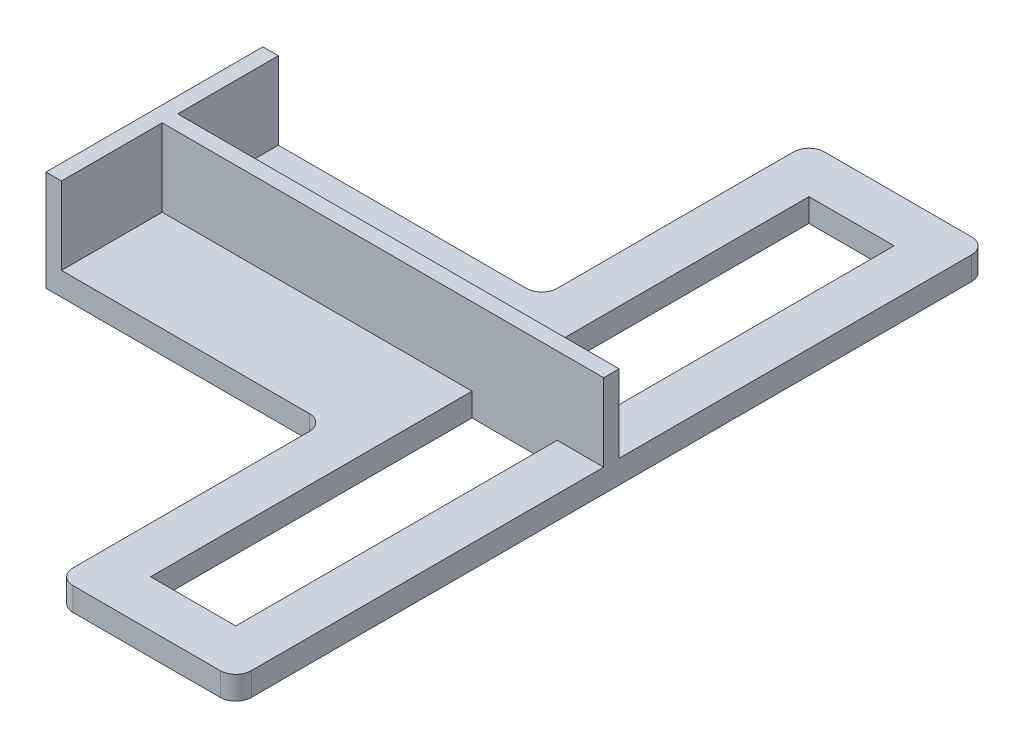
ISO-10303-21;
HEADER;
FILE_DESCRIPTION(('STEP AP214'),'2;1');
FILE_NAME('part.step','',(''),(''),'','','');
FILE_SCHEMA(('AUTOMOTIVE_DESIGN { 1 0 10303 214 1 1 1 1 }'));
ENDSEC;
DATA;
#1=APPLICATION_CONTEXT('core data for automotive mechanical design processes');
#2=APPLICATION_PROTOCOL_DEFINITION('international standard','automotive_design',2000,#1);
#3=PRODUCT_CONTEXT('',#1,'mechanical');
#4=PRODUCT('Part','Part','',(#3));
#5=PRODUCT_RELATED_PRODUCT_CATEGORY('part','',(#4));
#6=PRODUCT_DEFINITION_FORMATION('','',#4);
#7=PRODUCT_DEFINITION_CONTEXT('part definition',#1,'design');
#8=PRODUCT_DEFINITION('design','',#6,#7);
#9=PRODUCT_DEFINITION_SHAPE('','',#8);
#10=(LENGTH_UNIT() NAMED_UNIT(*) SI_UNIT(.MILLI.,.METRE.));
#11=(NAMED_UNIT(*) PLANE_ANGLE_UNIT() SI_UNIT($,.RADIAN.));
#12=(NAMED_UNIT(*) SI_UNIT($,.STERADIAN.) SOLID_ANGLE_UNIT());
#13=UNCERTAINTY_MEASURE_WITH_UNIT(LENGTH_MEASURE(1.E-05),#10,'distance_accuracy_value','');
#14=(GEOMETRIC_REPRESENTATION_CONTEXT(3) GLOBAL_UNCERTAINTY_ASSIGNED_CONTEXT((#13)) GLOBAL_UNIT_ASSIGNED_CONTEXT((#10,
#11,#12)) REPRESENTATION_CONTEXT('',''));
#15=CARTESIAN_POINT('',(0.,0.,0.));
#16=DIRECTION('',(0.,0.,1.));
#17=DIRECTION('',(1.,0.,0.));
#18=AXIS2_PLACEMENT_3D('',#15,#16,#17);
#19=CARTESIAN_POINT('',(0.,3.,0.));
#20=DIRECTION('',(0.,1.,0.));
#21=DIRECTION('',(0.,0.,1.));
#22=AXIS2_PLACEMENT_3D('',#19,#20,#21);
#23=PLANE('',#22);
#24=DIRECTION('',(1.,0.,0.));
#25=VECTOR('',#24,1.);
#26=CARTESIAN_POINT('',(-45.5,3.,-20.75));
#27=LINE('',#26,#25);
#28=CARTESIAN_POINT('',(5.5,3.,-20.75));
#29=VERTEX_POINT('',#28);
#30=CARTESIAN_POINT('',(11.5010737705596,3.,-20.75));
#31=VERTEX_POINT('',#30);
#32=EDGE_CURVE('E11',#29,#31,#27,.T.);
#33=ORIENTED_EDGE('',*,*,#32,.F.);
#34=DIRECTION('',(0.,0.,-1.));
#35=VECTOR('',#34,1.);
#36=CARTESIAN_POINT('',(5.5,3.,0.));
#37=LINE('',#36,#35);
#38=CARTESIAN_POINT('',(5.5,3.,20.75));
#39=VERTEX_POINT('',#38);
#40=EDGE_CURVE('E270',#39,#29,#37,.T.);
#41=ORIENTED_EDGE('',*,*,#40,.F.);
#42=DIRECTION('',(-1.,0.,0.));
#43=VECTOR('',#42,1.);
#44=CARTESIAN_POINT('',(0.,3.,20.75));
#45=LINE('',#44,#43);
#46=CARTESIAN_POINT('',(-5.5,3.,20.75));
#47=VERTEX_POINT('',#46);
#48=EDGE_CURVE('E273',#39,#47,#45,.T.);
#49=ORIENTED_EDGE('',*,*,#48,.T.);
#50=DIRECTION('',(0.,0.,-1.));
#51=VECTOR('',#50,1.);
#52=CARTESIAN_POINT('',(-5.5,3.,0.));
#53=LINE('',#52,#51);
#54=CARTESIAN_POINT('',(-5.5,3.,-20.75));
#55=VERTEX_POINT('',#54);
#56=EDGE_CURVE('E268',#47,#55,#53,.T.);
#57=ORIENTED_EDGE('',*,*,#56,.T.);
#58=CARTESIAN_POINT('',(-45.5,3.,-20.75));
#59=VERTEX_POINT('',#58);
#60=EDGE_CURVE('E49',#59,#55,#27,.T.);
#61=ORIENTED_EDGE('',*,*,#60,.F.);
#62=DIRECTION('',(0.,0.,-1.));
#63=VECTOR('',#62,1.);
#64=CARTESIAN_POINT('',(-45.5,3.,-20.75));
#65=LINE('',#64,#63);
#66=CARTESIAN_POINT('',(-45.5,3.,-7.75));
#67=VERTEX_POINT('',#66);
#68=EDGE_CURVE('E59',#67,#59,#65,.T.);
#69=ORIENTED_EDGE('',*,*,#68,.F.);
#70=DIRECTION('',(-1.,0.,0.));
#71=VECTOR('',#70,1.);
#72=CARTESIAN_POINT('',(0.,3.,-7.75000000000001));
#73=LINE('',#72,#71);
#74=CARTESIAN_POINT('',(-13.5,3.,-7.75000000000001));
#75=VERTEX_POINT('',#74);
#76=EDGE_CURVE('E283',#75,#67,#73,.T.);
#77=ORIENTED_EDGE('',*,*,#76,.F.);
#78=CARTESIAN_POINT('',(-13.5,3.,-5.75000000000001));
#79=DIRECTION('',(0.,1.,0.));
#80=DIRECTION('',(0.,0.,1.));
#81=AXIS2_PLACEMENT_3D('',#78,#79,#80);
#82=CIRCLE('',#81,2.);
#83=CARTESIAN_POINT('',(-11.5,3.,-5.75000000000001));
#84=VERTEX_POINT('',#83);
#85=EDGE_CURVE('E42',#75,#84,#82,.F.);
#86=ORIENTED_EDGE('',*,*,#85,.T.);
#87=DIRECTION('',(0.,0.,1.));
#88=VECTOR('',#87,1.);
#89=CARTESIAN_POINT('',(-11.5,3.,0.));
#90=LINE('',#89,#88);
#91=CARTESIAN_POINT('',(-11.5,3.,24.75));
#92=VERTEX_POINT('',#91);
#93=EDGE_CURVE('E285',#84,#92,#90,.T.);
#94=ORIENTED_EDGE('',*,*,#93,.T.);
#95=CARTESIAN_POINT('',(-9.5,3.,24.75));
#96=DIRECTION('',(0.,1.,0.));
#97=DIRECTION('',(0.,0.,1.));
#98=AXIS2_PLACEMENT_3D('',#95,#96,#97);
#99=CIRCLE('',#98,2.);
#100=CARTESIAN_POINT('',(-9.5,3.,26.75));
#101=VERTEX_POINT('',#100);
#102=EDGE_CURVE('E391',#92,#101,#99,.T.);
#103=ORIENTED_EDGE('',*,*,#102,.T.);
#104=DIRECTION('',(-1.,0.,0.));
#105=VECTOR('',#104,1.);
#106=CARTESIAN_POINT('',(0.,3.,26.75));
#107=LINE('',#106,#105);
#108=CARTESIAN_POINT('',(9.50107377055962,3.,26.75));
#109=VERTEX_POINT('',#108);
#110=EDGE_CURVE('E288',#109,#101,#107,.T.);
#111=ORIENTED_EDGE('',*,*,#110,.F.);
#112=CARTESIAN_POINT('',(9.50107377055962,3.,24.75));
#113=DIRECTION('',(0.,1.,0.));
#114=DIRECTION('',(0.,0.,1.));
#115=AXIS2_PLACEMENT_3D('',#112,#113,#114);
#116=CIRCLE('',#115,2.);
#117=CARTESIAN_POINT('',(11.5010737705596,3.,24.75));
#118=VERTEX_POINT('',#117);
#119=EDGE_CURVE('E397',#109,#118,#116,.T.);
#120=ORIENTED_EDGE('',*,*,#119,.T.);
#121=DIRECTION('',(0.,0.,1.));
#122=VECTOR('',#121,1.);
#123=CARTESIAN_POINT('',(11.5010737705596,3.,0.));
#124=LINE('',#123,#122);
#125=EDGE_CURVE('E291',#31,#118,#124,.T.);
#126=ORIENTED_EDGE('',*,*,#125,.F.);
#127=EDGE_LOOP('',(#33,#41,#49,#57,#61,#69,#77,#86,#94,#103,#111,#120,#126));
#128=FACE_BOUND('',#127,.T.);
#129=ADVANCED_FACE('F38',(#128),#23,.T.);
#130=CARTESIAN_POINT('',(0.,3.,-70.25));
#131=DIRECTION('',(0.,0.,1.));
#132=DIRECTION('',(1.,0.,0.));
#133=AXIS2_PLACEMENT_3D('',#130,#131,#132);
#134=PLANE('',#133);
#135=DIRECTION('',(-1.,0.,0.));
#136=VECTOR('',#135,1.);
#137=CARTESIAN_POINT('',(0.,3.,-70.25));
#138=LINE('',#137,#136);
#139=CARTESIAN_POINT('',(9.50107377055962,3.,-70.25));
#140=VERTEX_POINT('',#139);
#141=CARTESIAN_POINT('',(-9.50000000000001,3.,-70.25));
#142=VERTEX_POINT('',#141);
#143=EDGE_CURVE('E275',#140,#142,#138,.T.);
#144=ORIENTED_EDGE('',*,*,#143,.F.);
#145=DIRECTION('',(0.,-1.,0.));
#146=VECTOR('',#145,1.);
#147=CARTESIAN_POINT('',(9.50107377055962,0.,-70.25));
#148=LINE('',#147,#146);
#149=CARTESIAN_POINT('',(9.50107377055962,0.,-70.25));
#150=VERTEX_POINT('',#149);
#151=EDGE_CURVE('E402',#140,#150,#148,.T.);
#152=ORIENTED_EDGE('',*,*,#151,.T.);
#153=DIRECTION('',(-1.,0.,0.));
#154=VECTOR('',#153,1.);
#155=CARTESIAN_POINT('',(0.,0.,-70.25));
#156=LINE('',#155,#154);
#157=CARTESIAN_POINT('',(-9.50000000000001,0.,-70.25));
#158=VERTEX_POINT('',#157);
#159=EDGE_CURVE('E312',#150,#158,#156,.T.);
#160=ORIENTED_EDGE('',*,*,#159,.T.);
#161=DIRECTION('',(0.,-1.,0.));
#162=VECTOR('',#161,1.);
#163=CARTESIAN_POINT('',(-9.50000000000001,3.,-70.25));
#164=LINE('',#163,#162);
#165=EDGE_CURVE('E400',#158,#142,#164,.F.);
#166=ORIENTED_EDGE('',*,*,#165,.T.);
#167=EDGE_LOOP('',(#144,#152,#160,#166));
#168=FACE_BOUND('',#167,.T.);
#169=ADVANCED_FACE('F503',(#168),#134,.F.);
#170=CARTESIAN_POINT('',(-11.5,3.,0.));
#171=DIRECTION('',(1.,0.,0.));
#172=DIRECTION('',(0.,0.,-1.));
#173=AXIS2_PLACEMENT_3D('',#170,#171,#172);
#174=PLANE('',#173);
#175=DIRECTION('',(0.,0.,1.));
#176=VECTOR('',#175,1.);
#177=CARTESIAN_POINT('',(-11.5,0.,0.));
#178=LINE('',#177,#176);
#179=CARTESIAN_POINT('',(-11.5,0.,-68.25));
#180=VERTEX_POINT('',#179);
#181=CARTESIAN_POINT('',(-11.5,0.,-37.75));
#182=VERTEX_POINT('',#181);
#183=EDGE_CURVE('E315',#180,#182,#178,.T.);
#184=ORIENTED_EDGE('',*,*,#183,.T.);
#185=DIRECTION('',(0.,-1.,0.));
#186=VECTOR('',#185,1.);
#187=CARTESIAN_POINT('',(-11.5,3.,-37.75));
#188=LINE('',#187,#186);
#189=CARTESIAN_POINT('',(-11.5,3.,-37.75));
#190=VERTEX_POINT('',#189);
#191=EDGE_CURVE('E364',#182,#190,#188,.F.);
#192=ORIENTED_EDGE('',*,*,#191,.T.);
#193=DIRECTION('',(0.,0.,1.));
#194=VECTOR('',#193,1.);
#195=CARTESIAN_POINT('',(-11.5,3.,0.));
#196=LINE('',#195,#194);
#197=CARTESIAN_POINT('',(-11.5,3.,-68.25));
#198=VERTEX_POINT('',#197);
#199=EDGE_CURVE('E278',#198,#190,#196,.T.);
#200=ORIENTED_EDGE('',*,*,#199,.F.);
#201=DIRECTION('',(0.,-1.,0.));
#202=VECTOR('',#201,1.);
#203=CARTESIAN_POINT('',(-11.5,3.,-68.25));
#204=LINE('',#203,#202);
#205=EDGE_CURVE('E361',#198,#180,#204,.T.);
#206=ORIENTED_EDGE('',*,*,#205,.T.);
#207=EDGE_LOOP('',(#184,#192,#200,#206));
#208=FACE_BOUND('',#207,.T.);
#209=ADVANCED_FACE('F493',(#208),#174,.F.);
#210=CARTESIAN_POINT('',(0.,3.,-35.75));
#211=DIRECTION('',(0.,0.,-1.));
#212=DIRECTION('',(-1.,0.,0.));
#213=AXIS2_PLACEMENT_3D('',#210,#211,#212);
#214=PLANE('',#213);
#215=DIRECTION('',(0.,-1.,0.));
#216=VECTOR('',#215,1.);
#217=CARTESIAN_POINT('',(-47.5,3.,-35.75));
#218=LINE('',#217,#216);
#219=CARTESIAN_POINT('',(-47.5,13.,-35.75));
#220=VERTEX_POINT('',#219);
#221=CARTESIAN_POINT('',(-47.5,0.,-35.75));
#222=VERTEX_POINT('',#221);
#223=EDGE_CURVE('E337',#220,#222,#218,.T.);
#224=ORIENTED_EDGE('',*,*,#223,.F.);
#225=DIRECTION('',(-1.,0.,0.));
#226=VECTOR('',#225,1.);
#227=CARTESIAN_POINT('',(-47.5,13.,-35.75));
#228=LINE('',#227,#226);
#229=CARTESIAN_POINT('',(-45.5,13.,-35.75));
#230=VERTEX_POINT('',#229);
#231=EDGE_CURVE('E438',#230,#220,#228,.T.);
#232=ORIENTED_EDGE('',*,*,#231,.F.);
#233=DIRECTION('',(0.,-1.,0.));
#234=VECTOR('',#233,1.);
#235=CARTESIAN_POINT('',(-45.5,13.,-35.75));
#236=LINE('',#235,#234);
#237=CARTESIAN_POINT('',(-45.5,3.,-35.75));
#238=VERTEX_POINT('',#237);
#239=EDGE_CURVE('E256',#230,#238,#236,.T.);
#240=ORIENTED_EDGE('',*,*,#239,.T.);
#241=DIRECTION('',(1.,0.,0.));
#242=VECTOR('',#241,1.);
#243=CARTESIAN_POINT('',(0.,3.,-35.75));
#244=LINE('',#243,#242);
#245=CARTESIAN_POINT('',(-13.5,3.,-35.75));
#246=VERTEX_POINT('',#245);
#247=EDGE_CURVE('E281',#238,#246,#244,.T.);
#248=ORIENTED_EDGE('',*,*,#247,.T.);
#249=DIRECTION('',(0.,-1.,0.));
#250=VECTOR('',#249,1.);
#251=CARTESIAN_POINT('',(-13.5,3.,-35.75));
#252=LINE('',#251,#250);
#253=CARTESIAN_POINT('',(-13.5,0.,-35.75));
#254=VERTEX_POINT('',#253);
#255=EDGE_CURVE('E340',#246,#254,#252,.T.);
#256=ORIENTED_EDGE('',*,*,#255,.T.);
#257=DIRECTION('',(1.,0.,0.));
#258=VECTOR('',#257,1.);
#259=CARTESIAN_POINT('',(0.,0.,-35.75));
#260=LINE('',#259,#258);
#261=EDGE_CURVE('E318',#222,#254,#260,.T.);
#262=ORIENTED_EDGE('',*,*,#261,.F.);
#263=EDGE_LOOP('',(#224,#232,#240,#248,#256,#262));
#264=FACE_BOUND('',#263,.T.);
#265=ADVANCED_FACE('F436',(#264),#214,.T.);
#266=CARTESIAN_POINT('',(-47.5,3.,0.));
#267=DIRECTION('',(-1.,0.,0.));
#268=DIRECTION('',(0.,0.,1.));
#269=AXIS2_PLACEMENT_3D('',#266,#267,#268);
#270=PLANE('',#269);
#271=DIRECTION('',(0.,0.,-1.));
#272=VECTOR('',#271,1.);
#273=CARTESIAN_POINT('',(-47.5,0.,0.));
#274=LINE('',#273,#272);
#275=CARTESIAN_POINT('',(-47.5,0.,-7.75));
#276=VERTEX_POINT('',#275);
#277=EDGE_CURVE('E321',#276,#222,#274,.T.);
#278=ORIENTED_EDGE('',*,*,#277,.F.);
#279=DIRECTION('',(0.,-1.,0.));
#280=VECTOR('',#279,1.);
#281=CARTESIAN_POINT('',(-47.5,3.,-7.75));
#282=LINE('',#281,#280);
#283=CARTESIAN_POINT('',(-47.5,13.,-7.75));
#284=VERTEX_POINT('',#283);
#285=EDGE_CURVE('E334',#284,#276,#282,.T.);
#286=ORIENTED_EDGE('',*,*,#285,.F.);
#287=DIRECTION('',(0.,0.,1.));
#288=VECTOR('',#287,1.);
#289=CARTESIAN_POINT('',(-47.5,13.,-7.75));
#290=LINE('',#289,#288);
#291=EDGE_CURVE('E441',#220,#284,#290,.T.);
#292=ORIENTED_EDGE('',*,*,#291,.F.);
#293=ORIENTED_EDGE('',*,*,#223,.T.);
#294=EDGE_LOOP('',(#278,#286,#292,#293));
#295=FACE_BOUND('',#294,.T.);
#296=ADVANCED_FACE('F484',(#295),#270,.T.);
#297=CARTESIAN_POINT('',(0.,3.,-7.75000000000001));
#298=DIRECTION('',(0.,0.,1.));
#299=DIRECTION('',(1.,0.,0.));
#300=AXIS2_PLACEMENT_3D('',#297,#298,#299);
#301=PLANE('',#300);
#302=DIRECTION('',(-1.,0.,0.));
#303=VECTOR('',#302,1.);
#304=CARTESIAN_POINT('',(0.,0.,-7.75000000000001));
#305=LINE('',#304,#303);
#306=CARTESIAN_POINT('',(-13.5,0.,-7.75000000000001));
#307=VERTEX_POINT('',#306);
#308=EDGE_CURVE('E324',#307,#276,#305,.T.);
#309=ORIENTED_EDGE('',*,*,#308,.F.);
#310=DIRECTION('',(0.,-1.,0.));
#311=VECTOR('',#310,1.);
#312=CARTESIAN_POINT('',(-13.5,3.,-7.75000000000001));
#313=LINE('',#312,#311);
#314=EDGE_CURVE('E371',#307,#75,#313,.F.);
#315=ORIENTED_EDGE('',*,*,#314,.T.);
#316=ORIENTED_EDGE('',*,*,#76,.T.);
#317=DIRECTION('',(0.,-1.,0.));
#318=VECTOR('',#317,1.);
#319=CARTESIAN_POINT('',(-45.5,13.,-7.75000000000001));
#320=LINE('',#319,#318);
#321=CARTESIAN_POINT('',(-45.5,13.,-7.75000000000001));
#322=VERTEX_POINT('',#321);
#323=EDGE_CURVE('E432',#322,#67,#320,.T.);
#324=ORIENTED_EDGE('',*,*,#323,.F.);
#325=DIRECTION('',(1.,0.,0.));
#326=VECTOR('',#325,1.);
#327=CARTESIAN_POINT('',(-45.5,13.,-7.75000000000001));
#328=LINE('',#327,#326);
#329=EDGE_CURVE('E446',#284,#322,#328,.T.);
#330=ORIENTED_EDGE('',*,*,#329,.F.);
#331=ORIENTED_EDGE('',*,*,#285,.T.);
#332=EDGE_LOOP('',(#309,#315,#316,#324,#330,#331));
#333=FACE_BOUND('',#332,.T.);
#334=ADVANCED_FACE('F480',(#333),#301,.T.);
#335=CARTESIAN_POINT('',(-11.5,3.,0.));
#336=DIRECTION('',(1.,0.,0.));
#337=DIRECTION('',(0.,0.,-1.));
#338=AXIS2_PLACEMENT_3D('',#335,#336,#337);
#339=PLANE('',#338);
#340=ORIENTED_EDGE('',*,*,#93,.F.);
#341=DIRECTION('',(0.,-1.,0.));
#342=VECTOR('',#341,1.);
#343=CARTESIAN_POINT('',(-11.5,3.,-5.75000000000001));
#344=LINE('',#343,#342);
#345=CARTESIAN_POINT('',(-11.5,0.,-5.75000000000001));
#346=VERTEX_POINT('',#345);
#347=EDGE_CURVE('E368',#84,#346,#344,.T.);
#348=ORIENTED_EDGE('',*,*,#347,.T.);
#349=DIRECTION('',(0.,0.,1.));
#350=VECTOR('',#349,1.);
#351=CARTESIAN_POINT('',(-11.5,0.,0.));
#352=LINE('',#351,#350);
#353=CARTESIAN_POINT('',(-11.5,0.,24.75));
#354=VERTEX_POINT('',#353);
#355=EDGE_CURVE('E326',#346,#354,#352,.T.);
#356=ORIENTED_EDGE('',*,*,#355,.T.);
#357=DIRECTION('',(0.,-1.,0.));
#358=VECTOR('',#357,1.);
#359=CARTESIAN_POINT('',(-11.5,3.,24.75));
#360=LINE('',#359,#358);
#361=EDGE_CURVE('E366',#354,#92,#360,.F.);
#362=ORIENTED_EDGE('',*,*,#361,.T.);
#363=EDGE_LOOP('',(#340,#348,#356,#362));
#364=FACE_BOUND('',#363,.T.);
#365=ADVANCED_FACE('F474',(#364),#339,.F.);
#366=CARTESIAN_POINT('',(0.,3.,26.75));
#367=DIRECTION('',(0.,0.,1.));
#368=DIRECTION('',(1.,0.,0.));
#369=AXIS2_PLACEMENT_3D('',#366,#367,#368);
#370=PLANE('',#369);
#371=DIRECTION('',(-1.,0.,0.));
#372=VECTOR('',#371,1.);
#373=CARTESIAN_POINT('',(0.,0.,26.75));
#374=LINE('',#373,#372);
#375=CARTESIAN_POINT('',(9.50107377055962,0.,26.75));
#376=VERTEX_POINT('',#375);
#377=CARTESIAN_POINT('',(-9.5,0.,26.75));
#378=VERTEX_POINT('',#377);
#379=EDGE_CURVE('E329',#376,#378,#374,.T.);
#380=ORIENTED_EDGE('',*,*,#379,.F.);
#381=DIRECTION('',(0.,-1.,0.));
#382=VECTOR('',#381,1.);
#383=CARTESIAN_POINT('',(9.50107377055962,3.,26.75));
#384=LINE('',#383,#382);
#385=EDGE_CURVE('E389',#376,#109,#384,.F.);
#386=ORIENTED_EDGE('',*,*,#385,.T.);
#387=ORIENTED_EDGE('',*,*,#110,.T.);
#388=DIRECTION('',(0.,-1.,0.));
#389=VECTOR('',#388,1.);
#390=CARTESIAN_POINT('',(-9.5,0.,26.75));
#391=LINE('',#390,#389);
#392=EDGE_CURVE('E386',#101,#378,#391,.T.);
#393=ORIENTED_EDGE('',*,*,#392,.T.);
#394=EDGE_LOOP('',(#380,#386,#387,#393));
#395=FACE_BOUND('',#394,.T.);
#396=ADVANCED_FACE('F468',(#395),#370,.T.);
#397=CARTESIAN_POINT('',(-5.5,3.,0.));
#398=DIRECTION('',(-1.,0.,0.));
#399=DIRECTION('',(0.,0.,1.));
#400=AXIS2_PLACEMENT_3D('',#397,#398,#399);
#401=PLANE('',#400);
#402=DIRECTION('',(0.,0.,-1.));
#403=VECTOR('',#402,1.);
#404=CARTESIAN_POINT('',(-5.5,0.,0.));
#405=LINE('',#404,#403);
#406=CARTESIAN_POINT('',(-5.5,0.,20.75));
#407=VERTEX_POINT('',#406);
#408=CARTESIAN_POINT('',(-5.5,0.,-20.75));
#409=VERTEX_POINT('',#408);
#410=EDGE_CURVE('E301',#407,#409,#405,.T.);
#411=ORIENTED_EDGE('',*,*,#410,.T.);
#412=DIRECTION('',(0.,-1.,0.));
#413=VECTOR('',#412,1.);
#414=CARTESIAN_POINT('',(-5.5,3.,-20.75));
#415=LINE('',#414,#413);
#416=EDGE_CURVE('E338',#55,#409,#415,.T.);
#417=ORIENTED_EDGE('',*,*,#416,.F.);
#418=ORIENTED_EDGE('',*,*,#56,.F.);
#419=DIRECTION('',(0.,-1.,0.));
#420=VECTOR('',#419,1.);
#421=CARTESIAN_POINT('',(-5.5,3.,20.75));
#422=LINE('',#421,#420);
#423=EDGE_CURVE('E341',#47,#407,#422,.T.);
#424=ORIENTED_EDGE('',*,*,#423,.T.);
#425=EDGE_LOOP('',(#411,#417,#418,#424));
#426=FACE_BOUND('',#425,.T.);
#427=ADVANCED_FACE('F559',(#426),#401,.F.);
#428=CARTESIAN_POINT('',(0.,3.,-20.75));
#429=DIRECTION('',(0.,0.,-1.));
#430=DIRECTION('',(-1.,0.,0.));
#431=AXIS2_PLACEMENT_3D('',#428,#429,#430);
#432=PLANE('',#431);
#433=DIRECTION('',(1.,0.,0.));
#434=VECTOR('',#433,1.);
#435=CARTESIAN_POINT('',(0.,0.,-20.75));
#436=LINE('',#435,#434);
#437=CARTESIAN_POINT('',(5.5,0.,-20.75));
#438=VERTEX_POINT('',#437);
#439=EDGE_CURVE('E304',#409,#438,#436,.T.);
#440=ORIENTED_EDGE('',*,*,#439,.T.);
#441=DIRECTION('',(0.,-1.,0.));
#442=VECTOR('',#441,1.);
#443=CARTESIAN_POINT('',(5.5,3.,-20.75));
#444=LINE('',#443,#442);
#445=EDGE_CURVE('E347',#29,#438,#444,.T.);
#446=ORIENTED_EDGE('',*,*,#445,.F.);
#447=ORIENTED_EDGE('',*,*,#32,.T.);
#448=DIRECTION('',(0.,-1.,0.));
#449=VECTOR('',#448,1.);
#450=CARTESIAN_POINT('',(11.5010737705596,13.,-20.75));
#451=LINE('',#450,#449);
#452=CARTESIAN_POINT('',(11.5010737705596,13.,-20.75));
#453=VERTEX_POINT('',#452);
#454=EDGE_CURVE('E427',#453,#31,#451,.T.);
#455=ORIENTED_EDGE('',*,*,#454,.F.);
#456=DIRECTION('',(1.,0.,0.));
#457=VECTOR('',#456,1.);
#458=CARTESIAN_POINT('',(-45.5,13.,-20.75));
#459=LINE('',#458,#457);
#460=CARTESIAN_POINT('',(-45.5,13.,-20.75));
#461=VERTEX_POINT('',#460);
#462=EDGE_CURVE('E242',#461,#453,#459,.T.);
#463=ORIENTED_EDGE('',*,*,#462,.F.);
#464=DIRECTION('',(0.,-1.,0.));
#465=VECTOR('',#464,1.);
#466=CARTESIAN_POINT('',(-45.5,13.,-20.75));
#467=LINE('',#466,#465);
#468=EDGE_CURVE('E429',#461,#59,#467,.T.);
#469=ORIENTED_EDGE('',*,*,#468,.T.);
#470=ORIENTED_EDGE('',*,*,#60,.T.);
#471=ORIENTED_EDGE('',*,*,#416,.T.);
#472=EDGE_LOOP('',(#440,#446,#447,#455,#463,#469,#470,#471));
#473=FACE_BOUND('',#472,.T.);
#474=ADVANCED_FACE('F456',(#473),#432,.F.);
#475=CARTESIAN_POINT('',(5.5,3.,0.));
#476=DIRECTION('',(-1.,0.,0.));
#477=DIRECTION('',(0.,0.,1.));
#478=AXIS2_PLACEMENT_3D('',#475,#476,#477);
#479=PLANE('',#478);
#480=DIRECTION('',(0.,0.,-1.));
#481=VECTOR('',#480,1.);
#482=CARTESIAN_POINT('',(5.5,0.,0.));
#483=LINE('',#482,#481);
#484=CARTESIAN_POINT('',(5.5,0.,20.75));
#485=VERTEX_POINT('',#484);
#486=EDGE_CURVE('E307',#485,#438,#483,.T.);
#487=ORIENTED_EDGE('',*,*,#486,.F.);
#488=DIRECTION('',(0.,-1.,0.));
#489=VECTOR('',#488,1.);
#490=CARTESIAN_POINT('',(5.5,3.,20.75));
#491=LINE('',#490,#489);
#492=EDGE_CURVE('E344',#39,#485,#491,.T.);
#493=ORIENTED_EDGE('',*,*,#492,.F.);
#494=ORIENTED_EDGE('',*,*,#40,.T.);
#495=ORIENTED_EDGE('',*,*,#445,.T.);
#496=EDGE_LOOP('',(#487,#493,#494,#495));
#497=FACE_BOUND('',#496,.T.);
#498=ADVANCED_FACE('F527',(#497),#479,.T.);
#499=CARTESIAN_POINT('',(0.,3.,-64.25));
#500=DIRECTION('',(0.,0.,-1.));
#501=DIRECTION('',(-1.,0.,0.));
#502=AXIS2_PLACEMENT_3D('',#499,#500,#501);
#503=PLANE('',#502);
#504=DIRECTION('',(1.,0.,0.));
#505=VECTOR('',#504,1.);
#506=CARTESIAN_POINT('',(0.,0.,-64.25));
#507=LINE('',#506,#505);
#508=CARTESIAN_POINT('',(-5.50000000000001,0.,-64.25));
#509=VERTEX_POINT('',#508);
#510=CARTESIAN_POINT('',(5.49999999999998,0.,-64.25));
#511=VERTEX_POINT('',#510);
#512=EDGE_CURVE('E251',#509,#511,#507,.T.);
#513=ORIENTED_EDGE('',*,*,#512,.T.);
#514=DIRECTION('',(0.,-1.,0.));
#515=VECTOR('',#514,1.);
#516=CARTESIAN_POINT('',(5.49999999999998,3.,-64.25));
#517=LINE('',#516,#515);
#518=CARTESIAN_POINT('',(5.49999999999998,3.,-64.25));
#519=VERTEX_POINT('',#518);
#520=EDGE_CURVE('E345',#519,#511,#517,.T.);
#521=ORIENTED_EDGE('',*,*,#520,.F.);
#522=DIRECTION('',(1.,0.,0.));
#523=VECTOR('',#522,1.);
#524=CARTESIAN_POINT('',(0.,3.,-64.25));
#525=LINE('',#524,#523);
#526=CARTESIAN_POINT('',(-5.50000000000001,3.,-64.25));
#527=VERTEX_POINT('',#526);
#528=EDGE_CURVE('E260',#527,#519,#525,.T.);
#529=ORIENTED_EDGE('',*,*,#528,.F.);
#530=DIRECTION('',(0.,-1.,0.));
#531=VECTOR('',#530,1.);
#532=CARTESIAN_POINT('',(-5.50000000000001,3.,-64.25));
#533=LINE('',#532,#531);
#534=EDGE_CURVE('E292',#527,#509,#533,.T.);
#535=ORIENTED_EDGE('',*,*,#534,.T.);
#536=EDGE_LOOP('',(#513,#521,#529,#535));
#537=FACE_BOUND('',#536,.T.);
#538=ADVANCED_FACE('F525',(#537),#503,.F.);
#539=CARTESIAN_POINT('',(5.49999999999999,3.,0.));
#540=DIRECTION('',(1.,0.,0.));
#541=DIRECTION('',(0.,0.,-1.));
#542=AXIS2_PLACEMENT_3D('',#539,#540,#541);
#543=PLANE('',#542);
#544=DIRECTION('',(0.,0.,1.));
#545=VECTOR('',#544,1.);
#546=CARTESIAN_POINT('',(5.49999999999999,0.,0.));
#547=LINE('',#546,#545);
#548=CARTESIAN_POINT('',(5.49999999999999,0.,-22.75));
#549=VERTEX_POINT('',#548);
#550=EDGE_CURVE('E254',#511,#549,#547,.T.);
#551=ORIENTED_EDGE('',*,*,#550,.T.);
#552=DIRECTION('',(0.,-1.,0.));
#553=VECTOR('',#552,1.);
#554=CARTESIAN_POINT('',(5.49999999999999,3.,-22.75));
#555=LINE('',#554,#553);
#556=CARTESIAN_POINT('',(5.49999999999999,3.,-22.75));
#557=VERTEX_POINT('',#556);
#558=EDGE_CURVE('E355',#557,#549,#555,.T.);
#559=ORIENTED_EDGE('',*,*,#558,.F.);
#560=DIRECTION('',(0.,0.,1.));
#561=VECTOR('',#560,1.);
#562=CARTESIAN_POINT('',(5.49999999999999,3.,0.));
#563=LINE('',#562,#561);
#564=EDGE_CURVE('E263',#519,#557,#563,.T.);
#565=ORIENTED_EDGE('',*,*,#564,.F.);
#566=ORIENTED_EDGE('',*,*,#520,.T.);
#567=EDGE_LOOP('',(#551,#559,#565,#566));
#568=FACE_BOUND('',#567,.T.);
#569=ADVANCED_FACE('F515',(#568),#543,.F.);
#570=CARTESIAN_POINT('',(0.,3.,-22.75));
#571=DIRECTION('',(0.,0.,-1.));
#572=DIRECTION('',(-1.,0.,0.));
#573=AXIS2_PLACEMENT_3D('',#570,#571,#572);
#574=PLANE('',#573);
#575=DIRECTION('',(1.,0.,0.));
#576=VECTOR('',#575,1.);
#577=CARTESIAN_POINT('',(0.,0.,-22.75));
#578=LINE('',#577,#576);
#579=CARTESIAN_POINT('',(-5.50000000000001,0.,-22.75));
#580=VERTEX_POINT('',#579);
#581=EDGE_CURVE('E296',#580,#549,#578,.T.);
#582=ORIENTED_EDGE('',*,*,#581,.F.);
#583=DIRECTION('',(0.,-1.,0.));
#584=VECTOR('',#583,1.);
#585=CARTESIAN_POINT('',(-5.50000000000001,3.,-22.75));
#586=LINE('',#585,#584);
#587=CARTESIAN_POINT('',(-5.50000000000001,3.,-22.75));
#588=VERTEX_POINT('',#587);
#589=EDGE_CURVE('E353',#588,#580,#586,.T.);
#590=ORIENTED_EDGE('',*,*,#589,.F.);
#591=DIRECTION('',(-1.,0.,0.));
#592=VECTOR('',#591,1.);
#593=CARTESIAN_POINT('',(11.5010737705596,3.,-22.75));
#594=LINE('',#593,#592);
#595=CARTESIAN_POINT('',(-45.5,3.,-22.75));
#596=VERTEX_POINT('',#595);
#597=EDGE_CURVE('E47',#588,#596,#594,.T.);
#598=ORIENTED_EDGE('',*,*,#597,.T.);
#599=DIRECTION('',(0.,-1.,0.));
#600=VECTOR('',#599,1.);
#601=CARTESIAN_POINT('',(-45.5,13.,-22.75));
#602=LINE('',#601,#600);
#603=CARTESIAN_POINT('',(-45.5,13.,-22.75));
#604=VERTEX_POINT('',#603);
#605=EDGE_CURVE('E233',#604,#596,#602,.T.);
#606=ORIENTED_EDGE('',*,*,#605,.F.);
#607=DIRECTION('',(-1.,0.,0.));
#608=VECTOR('',#607,1.);
#609=CARTESIAN_POINT('',(11.5010737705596,13.,-22.75));
#610=LINE('',#609,#608);
#611=CARTESIAN_POINT('',(11.5010737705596,13.,-22.75));
#612=VERTEX_POINT('',#611);
#613=EDGE_CURVE('E224',#612,#604,#610,.T.);
#614=ORIENTED_EDGE('',*,*,#613,.F.);
#615=DIRECTION('',(0.,-1.,0.));
#616=VECTOR('',#615,1.);
#617=CARTESIAN_POINT('',(11.5010737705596,13.,-22.75));
#618=LINE('',#617,#616);
#619=CARTESIAN_POINT('',(11.5010737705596,3.,-22.75));
#620=VERTEX_POINT('',#619);
#621=EDGE_CURVE('E230',#612,#620,#618,.T.);
#622=ORIENTED_EDGE('',*,*,#621,.T.);
#623=EDGE_CURVE('E416',#620,#557,#594,.T.);
#624=ORIENTED_EDGE('',*,*,#623,.T.);
#625=ORIENTED_EDGE('',*,*,#558,.T.);
#626=EDGE_LOOP('',(#582,#590,#598,#606,#614,#622,#624,#625));
#627=FACE_BOUND('',#626,.T.);
#628=ADVANCED_FACE('F227',(#627),#574,.T.);
#629=CARTESIAN_POINT('',(0.,3.,20.75));
#630=DIRECTION('',(0.,0.,1.));
#631=DIRECTION('',(1.,0.,0.));
#632=AXIS2_PLACEMENT_3D('',#629,#630,#631);
#633=PLANE('',#632);
#634=DIRECTION('',(-1.,0.,0.));
#635=VECTOR('',#634,1.);
#636=CARTESIAN_POINT('',(0.,0.,20.75));
#637=LINE('',#636,#635);
#638=EDGE_CURVE('E310',#485,#407,#637,.T.);
#639=ORIENTED_EDGE('',*,*,#638,.T.);
#640=ORIENTED_EDGE('',*,*,#423,.F.);
#641=ORIENTED_EDGE('',*,*,#48,.F.);
#642=ORIENTED_EDGE('',*,*,#492,.T.);
#643=EDGE_LOOP('',(#639,#640,#641,#642));
#644=FACE_BOUND('',#643,.T.);
#645=ADVANCED_FACE('F554',(#644),#633,.F.);
#646=CARTESIAN_POINT('',(-5.50000000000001,3.,0.));
#647=DIRECTION('',(-1.,0.,0.));
#648=DIRECTION('',(0.,0.,1.));
#649=AXIS2_PLACEMENT_3D('',#646,#647,#648);
#650=PLANE('',#649);
#651=DIRECTION('',(0.,0.,-1.));
#652=VECTOR('',#651,1.);
#653=CARTESIAN_POINT('',(-5.50000000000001,0.,0.));
#654=LINE('',#653,#652);
#655=EDGE_CURVE('E299',#580,#509,#654,.T.);
#656=ORIENTED_EDGE('',*,*,#655,.T.);
#657=ORIENTED_EDGE('',*,*,#534,.F.);
#658=DIRECTION('',(0.,0.,-1.));
#659=VECTOR('',#658,1.);
#660=CARTESIAN_POINT('',(-5.50000000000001,3.,0.));
#661=LINE('',#660,#659);
#662=EDGE_CURVE('E266',#588,#527,#661,.T.);
#663=ORIENTED_EDGE('',*,*,#662,.F.);
#664=ORIENTED_EDGE('',*,*,#589,.T.);
#665=EDGE_LOOP('',(#656,#657,#663,#664));
#666=FACE_BOUND('',#665,.T.);
#667=ADVANCED_FACE('F523',(#666),#650,.F.);
#668=CARTESIAN_POINT('',(11.5010737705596,3.,0.));
#669=DIRECTION('',(1.,0.,0.));
#670=DIRECTION('',(0.,0.,-1.));
#671=AXIS2_PLACEMENT_3D('',#668,#669,#670);
#672=PLANE('',#671);
#673=CARTESIAN_POINT('',(11.5010737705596,3.,-68.25));
#674=VERTEX_POINT('',#673);
#675=EDGE_CURVE('E250',#674,#620,#124,.T.);
#676=ORIENTED_EDGE('',*,*,#675,.T.);
#677=ORIENTED_EDGE('',*,*,#621,.F.);
#678=DIRECTION('',(0.,0.,-1.));
#679=VECTOR('',#678,1.);
#680=CARTESIAN_POINT('',(11.5010737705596,13.,-20.75));
#681=LINE('',#680,#679);
#682=EDGE_CURVE('E237',#453,#612,#681,.T.);
#683=ORIENTED_EDGE('',*,*,#682,.F.);
#684=ORIENTED_EDGE('',*,*,#454,.T.);
#685=ORIENTED_EDGE('',*,*,#125,.T.);
#686=DIRECTION('',(0.,-1.,0.));
#687=VECTOR('',#686,1.);
#688=CARTESIAN_POINT('',(11.5010737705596,3.,24.75));
#689=LINE('',#688,#687);
#690=CARTESIAN_POINT('',(11.5010737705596,0.,24.75));
#691=VERTEX_POINT('',#690);
#692=EDGE_CURVE('E375',#118,#691,#689,.T.);
#693=ORIENTED_EDGE('',*,*,#692,.T.);
#694=DIRECTION('',(0.,0.,1.));
#695=VECTOR('',#694,1.);
#696=CARTESIAN_POINT('',(11.5010737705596,0.,0.));
#697=LINE('',#696,#695);
#698=CARTESIAN_POINT('',(11.5010737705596,0.,-68.25));
#699=VERTEX_POINT('',#698);
#700=EDGE_CURVE('E264',#699,#691,#697,.T.);
#701=ORIENTED_EDGE('',*,*,#700,.F.);
#702=DIRECTION('',(0.,-1.,0.));
#703=VECTOR('',#702,1.);
#704=CARTESIAN_POINT('',(11.5010737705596,3.,-68.25));
#705=LINE('',#704,#703);
#706=EDGE_CURVE('E373',#699,#674,#705,.F.);
#707=ORIENTED_EDGE('',*,*,#706,.T.);
#708=EDGE_LOOP('',(#676,#677,#683,#684,#685,#693,#701,#707));
#709=FACE_BOUND('',#708,.T.);
#710=ADVANCED_FACE('F248',(#709),#672,.T.);
#711=ORIENTED_EDGE('',*,*,#623,.F.);
#712=ORIENTED_EDGE('',*,*,#675,.F.);
#713=CARTESIAN_POINT('',(9.50107377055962,3.,-68.25));
#714=DIRECTION('',(0.,1.,0.));
#715=DIRECTION('',(0.,0.,1.));
#716=AXIS2_PLACEMENT_3D('',#713,#714,#715);
#717=CIRCLE('',#716,2.);
#718=EDGE_CURVE('E395',#674,#140,#717,.T.);
#719=ORIENTED_EDGE('',*,*,#718,.T.);
#720=ORIENTED_EDGE('',*,*,#143,.T.);
#721=CARTESIAN_POINT('',(-9.50000000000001,3.,-68.25));
#722=DIRECTION('',(0.,1.,0.));
#723=DIRECTION('',(0.,0.,1.));
#724=AXIS2_PLACEMENT_3D('',#721,#722,#723);
#725=CIRCLE('',#724,2.);
#726=EDGE_CURVE('E393',#142,#198,#725,.T.);
#727=ORIENTED_EDGE('',*,*,#726,.T.);
#728=ORIENTED_EDGE('',*,*,#199,.T.);
#729=CARTESIAN_POINT('',(-13.5,3.,-37.75));
#730=DIRECTION('',(0.,1.,0.));
#731=DIRECTION('',(0.,0.,1.));
#732=AXIS2_PLACEMENT_3D('',#729,#730,#731);
#733=CIRCLE('',#732,2.);
#734=EDGE_CURVE('E407',#190,#246,#733,.F.);
#735=ORIENTED_EDGE('',*,*,#734,.T.);
#736=ORIENTED_EDGE('',*,*,#247,.F.);
#737=DIRECTION('',(0.,0.,-1.));
#738=VECTOR('',#737,1.);
#739=CARTESIAN_POINT('',(-45.5,3.,-35.75));
#740=LINE('',#739,#738);
#741=EDGE_CURVE('E420',#596,#238,#740,.T.);
#742=ORIENTED_EDGE('',*,*,#741,.F.);
#743=ORIENTED_EDGE('',*,*,#597,.F.);
#744=ORIENTED_EDGE('',*,*,#662,.T.);
#745=ORIENTED_EDGE('',*,*,#528,.T.);
#746=ORIENTED_EDGE('',*,*,#564,.T.);
#747=EDGE_LOOP('',(#711,#712,#719,#720,#727,#728,#735,#736,#742,#743,#744,#745,#746));
#748=FACE_BOUND('',#747,.T.);
#749=ADVANCED_FACE('F510',(#748),#23,.T.);
#750=CARTESIAN_POINT('',(0.,0.,0.));
#751=DIRECTION('',(0.,1.,0.));
#752=DIRECTION('',(0.,0.,1.));
#753=AXIS2_PLACEMENT_3D('',#750,#751,#752);
#754=PLANE('',#753);
#755=ORIENTED_EDGE('',*,*,#512,.F.);
#756=ORIENTED_EDGE('',*,*,#655,.F.);
#757=ORIENTED_EDGE('',*,*,#581,.T.);
#758=ORIENTED_EDGE('',*,*,#550,.F.);
#759=EDGE_LOOP('',(#755,#756,#757,#758));
#760=FACE_BOUND('',#759,.T.);
#761=ORIENTED_EDGE('',*,*,#410,.F.);
#762=ORIENTED_EDGE('',*,*,#638,.F.);
#763=ORIENTED_EDGE('',*,*,#486,.T.);
#764=ORIENTED_EDGE('',*,*,#439,.F.);
#765=EDGE_LOOP('',(#761,#762,#763,#764));
#766=FACE_BOUND('',#765,.T.);
#767=ORIENTED_EDGE('',*,*,#700,.T.);
#768=CARTESIAN_POINT('',(9.50107377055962,0.,24.75));
#769=DIRECTION('',(0.,1.,0.));
#770=DIRECTION('',(0.,0.,1.));
#771=AXIS2_PLACEMENT_3D('',#768,#769,#770);
#772=CIRCLE('',#771,2.);
#773=EDGE_CURVE('E384',#691,#376,#772,.F.);
#774=ORIENTED_EDGE('',*,*,#773,.T.);
#775=ORIENTED_EDGE('',*,*,#379,.T.);
#776=CARTESIAN_POINT('',(-9.5,0.,24.75));
#777=DIRECTION('',(0.,1.,0.));
#778=DIRECTION('',(0.,0.,1.));
#779=AXIS2_PLACEMENT_3D('',#776,#777,#778);
#780=CIRCLE('',#779,2.);
#781=EDGE_CURVE('E378',#378,#354,#780,.F.);
#782=ORIENTED_EDGE('',*,*,#781,.T.);
#783=ORIENTED_EDGE('',*,*,#355,.F.);
#784=CARTESIAN_POINT('',(-13.5,0.,-5.75000000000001));
#785=DIRECTION('',(0.,1.,0.));
#786=DIRECTION('',(0.,0.,1.));
#787=AXIS2_PLACEMENT_3D('',#784,#785,#786);
#788=CIRCLE('',#787,2.);
#789=EDGE_CURVE('E409',#346,#307,#788,.T.);
#790=ORIENTED_EDGE('',*,*,#789,.T.);
#791=ORIENTED_EDGE('',*,*,#308,.T.);
#792=ORIENTED_EDGE('',*,*,#277,.T.);
#793=ORIENTED_EDGE('',*,*,#261,.T.);
#794=CARTESIAN_POINT('',(-13.5,0.,-37.75));
#795=DIRECTION('',(0.,1.,0.));
#796=DIRECTION('',(0.,0.,1.));
#797=AXIS2_PLACEMENT_3D('',#794,#795,#796);
#798=CIRCLE('',#797,2.);
#799=EDGE_CURVE('E405',#254,#182,#798,.T.);
#800=ORIENTED_EDGE('',*,*,#799,.T.);
#801=ORIENTED_EDGE('',*,*,#183,.F.);
#802=CARTESIAN_POINT('',(-9.50000000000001,0.,-68.25));
#803=DIRECTION('',(0.,1.,0.));
#804=DIRECTION('',(0.,0.,1.));
#805=AXIS2_PLACEMENT_3D('',#802,#803,#804);
#806=CIRCLE('',#805,2.);
#807=EDGE_CURVE('E380',#180,#158,#806,.F.);
#808=ORIENTED_EDGE('',*,*,#807,.T.);
#809=ORIENTED_EDGE('',*,*,#159,.F.);
#810=CARTESIAN_POINT('',(9.50107377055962,0.,-68.25));
#811=DIRECTION('',(0.,1.,0.));
#812=DIRECTION('',(0.,0.,1.));
#813=AXIS2_PLACEMENT_3D('',#810,#811,#812);
#814=CIRCLE('',#813,2.);
#815=EDGE_CURVE('E382',#150,#699,#814,.F.);
#816=ORIENTED_EDGE('',*,*,#815,.T.);
#817=EDGE_LOOP('',(#767,#774,#775,#782,#783,#790,#791,#792,#793,#800,#801,#808,#809,#816));
#818=FACE_BOUND('',#817,.T.);
#819=ADVANCED_FACE('F466',(#760,#766,#818),#754,.F.);
#820=CARTESIAN_POINT('',(-13.5,3.,-37.75));
#821=DIRECTION('',(0.,-1.,0.));
#822=DIRECTION('',(0.,0.,-1.));
#823=AXIS2_PLACEMENT_3D('',#820,#821,#822);
#824=CYLINDRICAL_SURFACE('',#823,2.);
#825=ORIENTED_EDGE('',*,*,#734,.F.);
#826=ORIENTED_EDGE('',*,*,#191,.F.);
#827=ORIENTED_EDGE('',*,*,#799,.F.);
#828=ORIENTED_EDGE('',*,*,#255,.F.);
#829=EDGE_LOOP('',(#825,#826,#827,#828));
#830=FACE_BOUND('',#829,.T.);
#831=ADVANCED_FACE('F489',(#830),#824,.F.);
#832=CARTESIAN_POINT('',(-13.5,3.,-5.75000000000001));
#833=DIRECTION('',(0.,-1.,0.));
#834=DIRECTION('',(0.,0.,-1.));
#835=AXIS2_PLACEMENT_3D('',#832,#833,#834);
#836=CYLINDRICAL_SURFACE('',#835,2.);
#837=ORIENTED_EDGE('',*,*,#85,.F.);
#838=ORIENTED_EDGE('',*,*,#314,.F.);
#839=ORIENTED_EDGE('',*,*,#789,.F.);
#840=ORIENTED_EDGE('',*,*,#347,.F.);
#841=EDGE_LOOP('',(#837,#838,#839,#840));
#842=FACE_BOUND('',#841,.T.);
#843=ADVANCED_FACE('F477',(#842),#836,.F.);
#844=CARTESIAN_POINT('',(9.50107377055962,3.,24.75));
#845=DIRECTION('',(0.,-1.,0.));
#846=DIRECTION('',(0.,0.,-1.));
#847=AXIS2_PLACEMENT_3D('',#844,#845,#846);
#848=CYLINDRICAL_SURFACE('',#847,2.);
#849=ORIENTED_EDGE('',*,*,#119,.F.);
#850=ORIENTED_EDGE('',*,*,#385,.F.);
#851=ORIENTED_EDGE('',*,*,#773,.F.);
#852=ORIENTED_EDGE('',*,*,#692,.F.);
#853=EDGE_LOOP('',(#849,#850,#851,#852));
#854=FACE_BOUND('',#853,.T.);
#855=ADVANCED_FACE('F464',(#854),#848,.T.);
#856=CARTESIAN_POINT('',(9.50107377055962,3.,-68.25));
#857=DIRECTION('',(0.,1.,0.));
#858=DIRECTION('',(0.,0.,1.));
#859=AXIS2_PLACEMENT_3D('',#856,#857,#858);
#860=CYLINDRICAL_SURFACE('',#859,2.);
#861=ORIENTED_EDGE('',*,*,#718,.F.);
#862=ORIENTED_EDGE('',*,*,#706,.F.);
#863=ORIENTED_EDGE('',*,*,#815,.F.);
#864=ORIENTED_EDGE('',*,*,#151,.F.);
#865=EDGE_LOOP('',(#861,#862,#863,#864));
#866=FACE_BOUND('',#865,.T.);
#867=ADVANCED_FACE('F507',(#866),#860,.T.);
#868=CARTESIAN_POINT('',(-9.50000000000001,3.,-68.25));
#869=DIRECTION('',(0.,-1.,0.));
#870=DIRECTION('',(0.,0.,-1.));
#871=AXIS2_PLACEMENT_3D('',#868,#869,#870);
#872=CYLINDRICAL_SURFACE('',#871,2.);
#873=ORIENTED_EDGE('',*,*,#726,.F.);
#874=ORIENTED_EDGE('',*,*,#165,.F.);
#875=ORIENTED_EDGE('',*,*,#807,.F.);
#876=ORIENTED_EDGE('',*,*,#205,.F.);
#877=EDGE_LOOP('',(#873,#874,#875,#876));
#878=FACE_BOUND('',#877,.T.);
#879=ADVANCED_FACE('F498',(#878),#872,.T.);
#880=CARTESIAN_POINT('',(-9.5,3.,24.75));
#881=DIRECTION('',(0.,1.,0.));
#882=DIRECTION('',(0.,0.,1.));
#883=AXIS2_PLACEMENT_3D('',#880,#881,#882);
#884=CYLINDRICAL_SURFACE('',#883,2.);
#885=ORIENTED_EDGE('',*,*,#102,.F.);
#886=ORIENTED_EDGE('',*,*,#361,.F.);
#887=ORIENTED_EDGE('',*,*,#781,.F.);
#888=ORIENTED_EDGE('',*,*,#392,.F.);
#889=EDGE_LOOP('',(#885,#886,#887,#888));
#890=FACE_BOUND('',#889,.T.);
#891=ADVANCED_FACE('F40',(#890),#884,.T.);
#892=CARTESIAN_POINT('',(-45.5,13.,-35.75));
#893=DIRECTION('',(-1.,0.,0.));
#894=DIRECTION('',(0.,0.,1.));
#895=AXIS2_PLACEMENT_3D('',#892,#893,#894);
#896=PLANE('',#895);
#897=ORIENTED_EDGE('',*,*,#741,.T.);
#898=ORIENTED_EDGE('',*,*,#239,.F.);
#899=DIRECTION('',(0.,0.,-1.));
#900=VECTOR('',#899,1.);
#901=CARTESIAN_POINT('',(-45.5,13.,-35.75));
#902=LINE('',#901,#900);
#903=EDGE_CURVE('E236',#604,#230,#902,.T.);
#904=ORIENTED_EDGE('',*,*,#903,.F.);
#905=ORIENTED_EDGE('',*,*,#605,.T.);
#906=EDGE_LOOP('',(#897,#898,#904,#905));
#907=FACE_BOUND('',#906,.T.);
#908=ADVANCED_FACE('F439',(#907),#896,.F.);
#909=CARTESIAN_POINT('',(-45.5,13.,-20.75));
#910=DIRECTION('',(-1.,0.,0.));
#911=DIRECTION('',(0.,0.,1.));
#912=AXIS2_PLACEMENT_3D('',#909,#910,#911);
#913=PLANE('',#912);
#914=ORIENTED_EDGE('',*,*,#68,.T.);
#915=ORIENTED_EDGE('',*,*,#468,.F.);
#916=DIRECTION('',(0.,0.,-1.));
#917=VECTOR('',#916,1.);
#918=CARTESIAN_POINT('',(-45.5,13.,-20.75));
#919=LINE('',#918,#917);
#920=EDGE_CURVE('E448',#322,#461,#919,.T.);
#921=ORIENTED_EDGE('',*,*,#920,.F.);
#922=ORIENTED_EDGE('',*,*,#323,.T.);
#923=EDGE_LOOP('',(#914,#915,#921,#922));
#924=FACE_BOUND('',#923,.T.);
#925=ADVANCED_FACE('F454',(#924),#913,.F.);
#926=CARTESIAN_POINT('',(0.,13.,0.));
#927=DIRECTION('',(0.,1.,0.));
#928=DIRECTION('',(0.,0.,1.));
#929=AXIS2_PLACEMENT_3D('',#926,#927,#928);
#930=PLANE('',#929);
#931=ORIENTED_EDGE('',*,*,#682,.T.);
#932=ORIENTED_EDGE('',*,*,#613,.T.);
#933=ORIENTED_EDGE('',*,*,#903,.T.);
#934=ORIENTED_EDGE('',*,*,#231,.T.);
#935=ORIENTED_EDGE('',*,*,#291,.T.);
#936=ORIENTED_EDGE('',*,*,#329,.T.);
#937=ORIENTED_EDGE('',*,*,#920,.T.);
#938=ORIENTED_EDGE('',*,*,#462,.T.);
#939=EDGE_LOOP('',(#931,#932,#933,#934,#935,#936,#937,#938));
#940=FACE_BOUND('',#939,.T.);
#941=ADVANCED_FACE('F240',(#940),#930,.T.);
#942=CLOSED_SHELL('',(#129,#169,#209,#265,#296,#334,#365,#396,#427,#474,#498,#538,#569,#628,
#645,#667,#710,#749,#819,#831,#843,#855,#867,#879,#891,#908,#925,#941));
#943=MANIFOLD_SOLID_BREP('B2',#942);
#944=ADVANCED_BREP_SHAPE_REPRESENTATION('',(#18,#943),#14);
#945=SHAPE_DEFINITION_REPRESENTATION(#9,#944);
ENDSEC;
END-ISO-10303-21;
